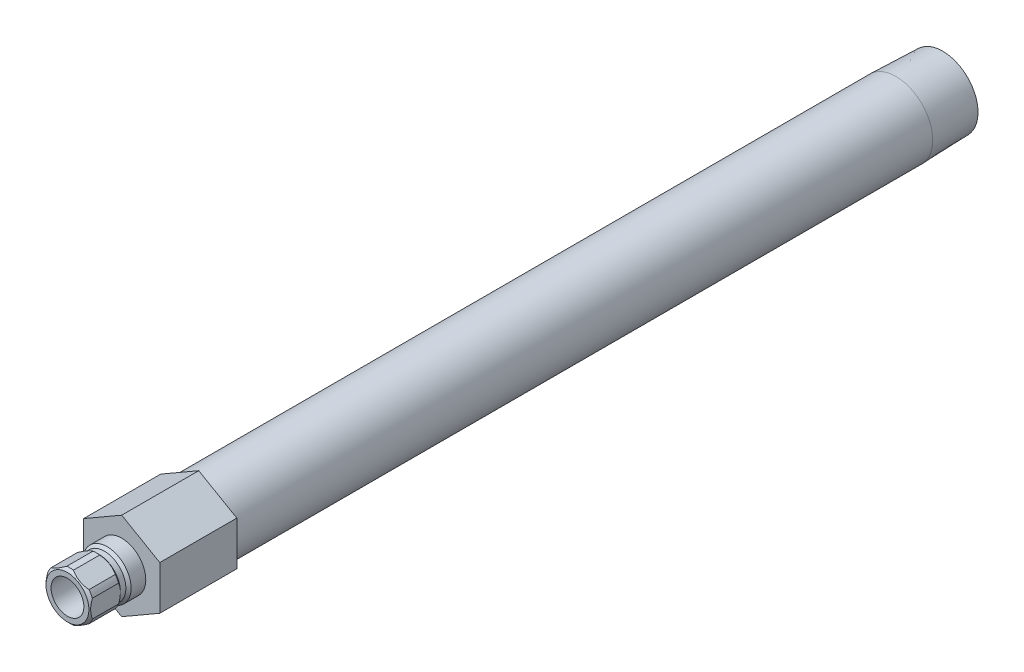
ISO-10303-21;
HEADER;
FILE_DESCRIPTION(('STEP AP214'),'2;1');
FILE_NAME('part.step','',(''),(''),'','','');
FILE_SCHEMA(('AUTOMOTIVE_DESIGN { 1 0 10303 214 1 1 1 1 }'));
ENDSEC;
DATA;
#1=APPLICATION_CONTEXT('core data for automotive mechanical design processes');
#2=APPLICATION_PROTOCOL_DEFINITION('international standard','automotive_design',2000,#1);
#3=PRODUCT_CONTEXT('',#1,'mechanical');
#4=PRODUCT('Part','Part','',(#3));
#5=PRODUCT_RELATED_PRODUCT_CATEGORY('part','',(#4));
#6=PRODUCT_DEFINITION_FORMATION('','',#4);
#7=PRODUCT_DEFINITION_CONTEXT('part definition',#1,'design');
#8=PRODUCT_DEFINITION('design','',#6,#7);
#9=PRODUCT_DEFINITION_SHAPE('','',#8);
#10=(LENGTH_UNIT() NAMED_UNIT(*) SI_UNIT(.MILLI.,.METRE.));
#11=(NAMED_UNIT(*) PLANE_ANGLE_UNIT() SI_UNIT($,.RADIAN.));
#12=(NAMED_UNIT(*) SI_UNIT($,.STERADIAN.) SOLID_ANGLE_UNIT());
#13=UNCERTAINTY_MEASURE_WITH_UNIT(LENGTH_MEASURE(1.E-05),#10,'distance_accuracy_value','');
#14=(GEOMETRIC_REPRESENTATION_CONTEXT(3) GLOBAL_UNCERTAINTY_ASSIGNED_CONTEXT((#13)) GLOBAL_UNIT_ASSIGNED_CONTEXT((#10,
#11,#12)) REPRESENTATION_CONTEXT('',''));
#15=CARTESIAN_POINT('',(0.,0.,0.));
#16=DIRECTION('',(0.,0.,1.));
#17=DIRECTION('',(1.,0.,0.));
#18=AXIS2_PLACEMENT_3D('',#15,#16,#17);
#19=CARTESIAN_POINT('',(0.,0.,13.1223734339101));
#20=DIRECTION('',(0.,0.,-1.));
#21=DIRECTION('',(0.,1.,0.));
#22=AXIS2_PLACEMENT_3D('',#19,#20,#21);
#23=CYLINDRICAL_SURFACE('',#22,6.985);
#24=DIRECTION('',(0.,0.,-1.));
#25=VECTOR('',#24,1.);
#26=CARTESIAN_POINT('',(5.50323442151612,-4.30170151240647,13.1223734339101));
#27=LINE('',#26,#25);
#28=CARTESIAN_POINT('',(5.50323442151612,-4.30170151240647,7.366));
#29=VERTEX_POINT('',#28);
#30=CARTESIAN_POINT('',(5.50323442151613,-4.30170151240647,14.986));
#31=VERTEX_POINT('',#30);
#32=EDGE_CURVE('E406',#29,#31,#27,.F.);
#33=ORIENTED_EDGE('',*,*,#32,.F.);
#34=CARTESIAN_POINT('',(0.,0.,7.366));
#35=DIRECTION('',(0.,0.,-1.));
#36=DIRECTION('',(0.,1.,0.));
#37=AXIS2_PLACEMENT_3D('',#34,#35,#36);
#38=CIRCLE('',#37,6.985);
#39=CARTESIAN_POINT('',(6.477,-2.61509005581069,7.366));
#40=VERTEX_POINT('',#39);
#41=EDGE_CURVE('E383',#40,#29,#38,.T.);
#42=ORIENTED_EDGE('',*,*,#41,.F.);
#43=DIRECTION('',(0.,0.,-1.));
#44=VECTOR('',#43,1.);
#45=CARTESIAN_POINT('',(6.477,-2.61509005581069,13.1223734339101));
#46=LINE('',#45,#44);
#47=CARTESIAN_POINT('',(6.477,-2.6150900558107,14.986));
#48=VERTEX_POINT('',#47);
#49=EDGE_CURVE('E397',#48,#40,#46,.T.);
#50=ORIENTED_EDGE('',*,*,#49,.F.);
#51=CARTESIAN_POINT('',(0.,0.,14.986));
#52=DIRECTION('',(0.,0.,-1.));
#53=DIRECTION('',(0.,1.,0.));
#54=AXIS2_PLACEMENT_3D('',#51,#52,#53);
#55=CIRCLE('',#54,6.985);
#56=EDGE_CURVE('E191',#48,#31,#55,.T.);
#57=ORIENTED_EDGE('',*,*,#56,.T.);
#58=EDGE_LOOP('',(#33,#42,#50,#57));
#59=FACE_BOUND('',#58,.T.);
#60=ADVANCED_FACE('F34',(#59),#23,.T.);
#61=DIRECTION('',(0.,0.,-1.));
#62=VECTOR('',#61,1.);
#63=CARTESIAN_POINT('',(6.477,2.6150900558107,13.1223734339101));
#64=LINE('',#63,#62);
#65=CARTESIAN_POINT('',(6.477,2.6150900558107,7.366));
#66=VERTEX_POINT('',#65);
#67=CARTESIAN_POINT('',(6.477,2.6150900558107,14.986));
#68=VERTEX_POINT('',#67);
#69=EDGE_CURVE('E309',#66,#68,#64,.F.);
#70=ORIENTED_EDGE('',*,*,#69,.F.);
#71=CARTESIAN_POINT('',(5.50323442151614,4.30170151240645,7.366));
#72=VERTEX_POINT('',#71);
#73=EDGE_CURVE('E204',#72,#66,#38,.T.);
#74=ORIENTED_EDGE('',*,*,#73,.F.);
#75=DIRECTION('',(0.,0.,-1.));
#76=VECTOR('',#75,1.);
#77=CARTESIAN_POINT('',(5.50323442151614,4.30170151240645,13.1223734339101));
#78=LINE('',#77,#76);
#79=CARTESIAN_POINT('',(5.50323442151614,4.30170151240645,14.986));
#80=VERTEX_POINT('',#79);
#81=EDGE_CURVE('E394',#80,#72,#78,.T.);
#82=ORIENTED_EDGE('',*,*,#81,.F.);
#83=EDGE_CURVE('E198',#80,#68,#55,.T.);
#84=ORIENTED_EDGE('',*,*,#83,.T.);
#85=EDGE_LOOP('',(#70,#74,#82,#84));
#86=FACE_BOUND('',#85,.T.);
#87=ADVANCED_FACE('F343',(#86),#23,.T.);
#88=DIRECTION('',(0.,0.,-1.));
#89=VECTOR('',#88,1.);
#90=CARTESIAN_POINT('',(0.973765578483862,6.91679156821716,13.1223734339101));
#91=LINE('',#90,#89);
#92=CARTESIAN_POINT('',(0.973765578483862,6.91679156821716,7.366));
#93=VERTEX_POINT('',#92);
#94=CARTESIAN_POINT('',(0.973765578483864,6.91679156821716,14.986));
#95=VERTEX_POINT('',#94);
#96=EDGE_CURVE('E399',#93,#95,#91,.F.);
#97=ORIENTED_EDGE('',*,*,#96,.F.);
#98=CARTESIAN_POINT('',(-0.973765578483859,6.91679156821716,7.366));
#99=VERTEX_POINT('',#98);
#100=EDGE_CURVE('E200',#99,#93,#38,.T.);
#101=ORIENTED_EDGE('',*,*,#100,.F.);
#102=DIRECTION('',(0.,0.,-1.));
#103=VECTOR('',#102,1.);
#104=CARTESIAN_POINT('',(-0.973765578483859,6.91679156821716,13.1223734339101));
#105=LINE('',#104,#103);
#106=CARTESIAN_POINT('',(-0.973765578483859,6.91679156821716,14.986));
#107=VERTEX_POINT('',#106);
#108=EDGE_CURVE('E375',#107,#99,#105,.T.);
#109=ORIENTED_EDGE('',*,*,#108,.F.);
#110=EDGE_CURVE('E193',#107,#95,#55,.T.);
#111=ORIENTED_EDGE('',*,*,#110,.T.);
#112=EDGE_LOOP('',(#97,#101,#109,#111));
#113=FACE_BOUND('',#112,.T.);
#114=ADVANCED_FACE('F348',(#113),#23,.T.);
#115=DIRECTION('',(0.,0.,-1.));
#116=VECTOR('',#115,1.);
#117=CARTESIAN_POINT('',(-5.50323442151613,4.30170151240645,13.1223734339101));
#118=LINE('',#117,#116);
#119=CARTESIAN_POINT('',(-5.50323442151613,4.30170151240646,7.366));
#120=VERTEX_POINT('',#119);
#121=CARTESIAN_POINT('',(-5.50323442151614,4.30170151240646,14.986));
#122=VERTEX_POINT('',#121);
#123=EDGE_CURVE('E54',#120,#122,#118,.F.);
#124=ORIENTED_EDGE('',*,*,#123,.F.);
#125=CARTESIAN_POINT('',(-6.477,2.6150900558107,7.366));
#126=VERTEX_POINT('',#125);
#127=EDGE_CURVE('E203',#126,#120,#38,.T.);
#128=ORIENTED_EDGE('',*,*,#127,.F.);
#129=DIRECTION('',(0.,0.,-1.));
#130=VECTOR('',#129,1.);
#131=CARTESIAN_POINT('',(-6.477,2.6150900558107,13.1223734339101));
#132=LINE('',#131,#130);
#133=CARTESIAN_POINT('',(-6.477,2.61509005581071,14.986));
#134=VERTEX_POINT('',#133);
#135=EDGE_CURVE('E263',#134,#126,#132,.T.);
#136=ORIENTED_EDGE('',*,*,#135,.F.);
#137=EDGE_CURVE('E189',#134,#122,#55,.T.);
#138=ORIENTED_EDGE('',*,*,#137,.T.);
#139=EDGE_LOOP('',(#124,#128,#136,#138));
#140=FACE_BOUND('',#139,.T.);
#141=ADVANCED_FACE('F360',(#140),#23,.T.);
#142=DIRECTION('',(0.,0.,-1.));
#143=VECTOR('',#142,1.);
#144=CARTESIAN_POINT('',(-6.477,-2.6150900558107,13.1223734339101));
#145=LINE('',#144,#143);
#146=CARTESIAN_POINT('',(-6.477,-2.61509005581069,7.366));
#147=VERTEX_POINT('',#146);
#148=CARTESIAN_POINT('',(-6.477,-2.6150900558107,14.986));
#149=VERTEX_POINT('',#148);
#150=EDGE_CURVE('E62',#147,#149,#145,.F.);
#151=ORIENTED_EDGE('',*,*,#150,.F.);
#152=CARTESIAN_POINT('',(-5.50323442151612,-4.30170151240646,7.366));
#153=VERTEX_POINT('',#152);
#154=EDGE_CURVE('E182',#153,#147,#38,.T.);
#155=ORIENTED_EDGE('',*,*,#154,.F.);
#156=DIRECTION('',(0.,0.,-1.));
#157=VECTOR('',#156,1.);
#158=CARTESIAN_POINT('',(-5.50323442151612,-4.30170151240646,13.1223734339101));
#159=LINE('',#158,#157);
#160=CARTESIAN_POINT('',(-5.50323442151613,-4.30170151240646,14.986));
#161=VERTEX_POINT('',#160);
#162=EDGE_CURVE('E165',#161,#153,#159,.T.);
#163=ORIENTED_EDGE('',*,*,#162,.F.);
#164=EDGE_CURVE('E180',#161,#149,#55,.T.);
#165=ORIENTED_EDGE('',*,*,#164,.T.);
#166=EDGE_LOOP('',(#151,#155,#163,#165));
#167=FACE_BOUND('',#166,.T.);
#168=ADVANCED_FACE('F179',(#167),#23,.T.);
#169=CARTESIAN_POINT('',(0.,0.,13.1223734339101));
#170=DIRECTION('',(0.,0.,-1.));
#171=DIRECTION('',(0.,1.,0.));
#172=AXIS2_PLACEMENT_3D('',#169,#170,#171);
#173=CYLINDRICAL_SURFACE('',#172,10.6679999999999);
#174=CARTESIAN_POINT('',(0.,1.09761599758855E-13,-224.6884));
#175=DIRECTION('',(0.,0.,-1.));
#176=DIRECTION('',(0.,1.,0.));
#177=AXIS2_PLACEMENT_3D('',#174,#175,#176);
#178=CIRCLE('',#177,10.6679999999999);
#179=CARTESIAN_POINT('',(0.,10.668,-224.6884));
#180=VERTEX_POINT('',#179);
#181=EDGE_CURVE('E217',#180,#180,#178,.T.);
#182=ORIENTED_EDGE('',*,*,#181,.F.);
#183=EDGE_LOOP('',(#182));
#184=FACE_BOUND('',#183,.T.);
#185=CARTESIAN_POINT('',(0.,0.,-22.352));
#186=DIRECTION('',(0.,0.,1.));
#187=DIRECTION('',(1.,0.,0.));
#188=AXIS2_PLACEMENT_3D('',#185,#186,#187);
#189=CIRCLE('',#188,10.6679999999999);
#190=CARTESIAN_POINT('',(10.6679999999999,0.,-22.352));
#191=VERTEX_POINT('',#190);
#192=EDGE_CURVE('E231',#191,#191,#189,.F.);
#193=ORIENTED_EDGE('',*,*,#192,.T.);
#194=EDGE_LOOP('',(#193));
#195=FACE_BOUND('',#194,.T.);
#196=ADVANCED_FACE('F359',(#184,#195),#173,.T.);
#197=CARTESIAN_POINT('',(0.,0.,13.1223734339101));
#198=DIRECTION('',(0.,0.,-1.));
#199=DIRECTION('',(0.,1.,0.));
#200=AXIS2_PLACEMENT_3D('',#197,#198,#199);
#201=CYLINDRICAL_SURFACE('',#200,4.76249999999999);
#202=CARTESIAN_POINT('',(0.,0.,15.748));
#203=DIRECTION('',(0.,0.,-1.));
#204=DIRECTION('',(0.,1.,0.));
#205=AXIS2_PLACEMENT_3D('',#202,#203,#204);
#206=CIRCLE('',#205,4.7625);
#207=CARTESIAN_POINT('',(0.,4.7625,15.748));
#208=VERTEX_POINT('',#207);
#209=EDGE_CURVE('E233',#208,#208,#206,.T.);
#210=ORIENTED_EDGE('',*,*,#209,.F.);
#211=EDGE_LOOP('',(#210));
#212=FACE_BOUND('',#211,.T.);
#213=CARTESIAN_POINT('',(0.,0.,-22.352));
#214=DIRECTION('',(0.,0.,-1.));
#215=DIRECTION('',(0.,1.,0.));
#216=AXIS2_PLACEMENT_3D('',#213,#214,#215);
#217=CIRCLE('',#216,4.76249999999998);
#218=CARTESIAN_POINT('',(0.,4.7625,-22.352));
#219=VERTEX_POINT('',#218);
#220=EDGE_CURVE('E174',#219,#219,#217,.T.);
#221=ORIENTED_EDGE('',*,*,#220,.T.);
#222=EDGE_LOOP('',(#221));
#223=FACE_BOUND('',#222,.T.);
#224=ADVANCED_FACE('F36',(#212,#223),#201,.F.);
#225=CARTESIAN_POINT('',(0.,4.7625,-22.352));
#226=DIRECTION('',(0.,0.,-1.));
#227=DIRECTION('',(0.,1.,0.));
#228=AXIS2_PLACEMENT_3D('',#225,#226,#227);
#229=PLANE('',#228);
#230=CARTESIAN_POINT('',(0.,0.,-22.352));
#231=DIRECTION('',(0.,0.,-1.));
#232=DIRECTION('',(0.,1.,0.));
#233=AXIS2_PLACEMENT_3D('',#230,#231,#232);
#234=CIRCLE('',#233,7.89939999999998);
#235=CARTESIAN_POINT('',(0.,7.8994,-22.352));
#236=VERTEX_POINT('',#235);
#237=EDGE_CURVE('E226',#236,#236,#234,.T.);
#238=ORIENTED_EDGE('',*,*,#237,.T.);
#239=EDGE_LOOP('',(#238));
#240=FACE_BOUND('',#239,.T.);
#241=ORIENTED_EDGE('',*,*,#220,.F.);
#242=EDGE_LOOP('',(#241));
#243=FACE_BOUND('',#242,.T.);
#244=ADVANCED_FACE('F533',(#240,#243),#229,.T.);
#245=CARTESIAN_POINT('',(0.,0.,13.1223734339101));
#246=DIRECTION('',(0.,0.,-1.));
#247=DIRECTION('',(0.,1.,0.));
#248=AXIS2_PLACEMENT_3D('',#245,#246,#247);
#249=CYLINDRICAL_SURFACE('',#248,7.89939999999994);
#250=CARTESIAN_POINT('',(0.,1.15921110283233E-13,-238.252));
#251=DIRECTION('',(0.,0.,-1.));
#252=DIRECTION('',(0.,1.,0.));
#253=AXIS2_PLACEMENT_3D('',#250,#251,#252);
#254=CIRCLE('',#253,7.89939999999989);
#255=CARTESIAN_POINT('',(0.,7.8994,-238.252));
#256=VERTEX_POINT('',#255);
#257=EDGE_CURVE('E223',#256,#256,#254,.T.);
#258=ORIENTED_EDGE('',*,*,#257,.T.);
#259=EDGE_LOOP('',(#258));
#260=FACE_BOUND('',#259,.T.);
#261=ORIENTED_EDGE('',*,*,#237,.F.);
#262=EDGE_LOOP('',(#261));
#263=FACE_BOUND('',#262,.T.);
#264=ADVANCED_FACE('F530',(#260,#263),#249,.F.);
#265=CARTESIAN_POINT('',(0.,10.244140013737,-238.252));
#266=DIRECTION('',(0.,0.,-1.));
#267=DIRECTION('',(0.,1.,0.));
#268=AXIS2_PLACEMENT_3D('',#265,#266,#267);
#269=PLANE('',#268);
#270=CARTESIAN_POINT('',(0.,1.15921110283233E-13,-238.252));
#271=DIRECTION('',(0.,0.,-1.));
#272=DIRECTION('',(0.,1.,0.));
#273=AXIS2_PLACEMENT_3D('',#270,#271,#272);
#274=CIRCLE('',#273,10.2441400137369);
#275=CARTESIAN_POINT('',(0.,10.244140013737,-238.252));
#276=VERTEX_POINT('',#275);
#277=EDGE_CURVE('E220',#276,#276,#274,.T.);
#278=ORIENTED_EDGE('',*,*,#277,.T.);
#279=EDGE_LOOP('',(#278));
#280=FACE_BOUND('',#279,.T.);
#281=ORIENTED_EDGE('',*,*,#257,.F.);
#282=EDGE_LOOP('',(#281));
#283=FACE_BOUND('',#282,.T.);
#284=ADVANCED_FACE('F524',(#280,#283),#269,.T.);
#285=CARTESIAN_POINT('',(0.,1.15921110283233E-13,-238.252));
#286=DIRECTION('',(0.,0.,1.));
#287=DIRECTION('',(0.,-1.,0.));
#288=AXIS2_PLACEMENT_3D('',#285,#286,#287);
#289=CONICAL_SURFACE('',#288,10.2441400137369,0.0312396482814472);
#290=ORIENTED_EDGE('',*,*,#181,.T.);
#291=EDGE_LOOP('',(#290));
#292=FACE_BOUND('',#291,.T.);
#293=ORIENTED_EDGE('',*,*,#277,.F.);
#294=EDGE_LOOP('',(#293));
#295=FACE_BOUND('',#294,.T.);
#296=ADVANCED_FACE('F514',(#292,#295),#289,.T.);
#297=CARTESIAN_POINT('',(0.,6.985,0.));
#298=DIRECTION('',(0.,0.,1.));
#299=DIRECTION('',(0.,-1.,0.));
#300=AXIS2_PLACEMENT_3D('',#297,#298,#299);
#301=PLANE('',#300);
#302=CARTESIAN_POINT('',(0.,0.,0.));
#303=DIRECTION('',(0.,0.,-1.));
#304=DIRECTION('',(0.,1.,0.));
#305=AXIS2_PLACEMENT_3D('',#302,#303,#304);
#306=CIRCLE('',#305,6.98499999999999);
#307=CARTESIAN_POINT('',(0.,6.985,0.));
#308=VERTEX_POINT('',#307);
#309=EDGE_CURVE('E214',#308,#308,#306,.T.);
#310=ORIENTED_EDGE('',*,*,#309,.T.);
#311=EDGE_LOOP('',(#310));
#312=FACE_BOUND('',#311,.T.);
#313=DIRECTION('',(-0.866025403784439,-0.5,0.));
#314=VECTOR('',#313,1.);
#315=CARTESIAN_POINT('',(0.,12.7582862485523,0.));
#316=LINE('',#315,#314);
#317=CARTESIAN_POINT('',(0.,12.7582862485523,0.));
#318=VERTEX_POINT('',#317);
#319=CARTESIAN_POINT('',(-11.049,6.37914312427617,0.));
#320=VERTEX_POINT('',#319);
#321=EDGE_CURVE('E409',#318,#320,#316,.T.);
#322=ORIENTED_EDGE('',*,*,#321,.T.);
#323=DIRECTION('',(0.,-1.,0.));
#324=VECTOR('',#323,1.);
#325=CARTESIAN_POINT('',(-11.049,6.37914312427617,0.));
#326=LINE('',#325,#324);
#327=CARTESIAN_POINT('',(-11.049,-6.37914312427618,0.));
#328=VERTEX_POINT('',#327);
#329=EDGE_CURVE('E436',#320,#328,#326,.T.);
#330=ORIENTED_EDGE('',*,*,#329,.T.);
#331=DIRECTION('',(0.866025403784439,-0.5,0.));
#332=VECTOR('',#331,1.);
#333=CARTESIAN_POINT('',(-11.049,-6.37914312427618,0.));
#334=LINE('',#333,#332);
#335=CARTESIAN_POINT('',(0.,-12.7582862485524,0.));
#336=VERTEX_POINT('',#335);
#337=EDGE_CURVE('E439',#328,#336,#334,.T.);
#338=ORIENTED_EDGE('',*,*,#337,.T.);
#339=DIRECTION('',(0.866025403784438,0.5,0.));
#340=VECTOR('',#339,1.);
#341=CARTESIAN_POINT('',(0.,-12.7582862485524,0.));
#342=LINE('',#341,#340);
#343=CARTESIAN_POINT('',(11.049,-6.37914312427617,0.));
#344=VERTEX_POINT('',#343);
#345=EDGE_CURVE('E442',#336,#344,#342,.T.);
#346=ORIENTED_EDGE('',*,*,#345,.T.);
#347=DIRECTION('',(0.,1.,0.));
#348=VECTOR('',#347,1.);
#349=CARTESIAN_POINT('',(11.049,-6.37914312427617,0.));
#350=LINE('',#349,#348);
#351=CARTESIAN_POINT('',(11.049,6.37914312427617,0.));
#352=VERTEX_POINT('',#351);
#353=EDGE_CURVE('E445',#344,#352,#350,.T.);
#354=ORIENTED_EDGE('',*,*,#353,.T.);
#355=DIRECTION('',(-0.866025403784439,0.5,0.));
#356=VECTOR('',#355,1.);
#357=CARTESIAN_POINT('',(11.049,6.37914312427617,0.));
#358=LINE('',#357,#356);
#359=EDGE_CURVE('E418',#352,#318,#358,.T.);
#360=ORIENTED_EDGE('',*,*,#359,.T.);
#361=EDGE_LOOP('',(#322,#330,#338,#346,#354,#360));
#362=FACE_BOUND('',#361,.T.);
#363=ADVANCED_FACE('F511',(#312,#362),#301,.T.);
#364=CARTESIAN_POINT('',(0.,0.,13.1223734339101));
#365=DIRECTION('',(0.,0.,-1.));
#366=DIRECTION('',(0.,1.,0.));
#367=AXIS2_PLACEMENT_3D('',#364,#365,#366);
#368=CYLINDRICAL_SURFACE('',#367,6.98499999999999);
#369=CARTESIAN_POINT('',(0.,0.,4.25449999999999));
#370=DIRECTION('',(0.,0.,-1.));
#371=DIRECTION('',(0.,1.,0.));
#372=AXIS2_PLACEMENT_3D('',#369,#370,#371);
#373=CIRCLE('',#372,6.98499999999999);
#374=CARTESIAN_POINT('',(0.,6.985,4.2545));
#375=VERTEX_POINT('',#374);
#376=EDGE_CURVE('E211',#375,#375,#373,.T.);
#377=ORIENTED_EDGE('',*,*,#376,.T.);
#378=EDGE_LOOP('',(#377));
#379=FACE_BOUND('',#378,.T.);
#380=ORIENTED_EDGE('',*,*,#309,.F.);
#381=EDGE_LOOP('',(#380));
#382=FACE_BOUND('',#381,.T.);
#383=ADVANCED_FACE('F513',(#379,#382),#368,.T.);
#384=CARTESIAN_POINT('',(0.,0.,4.25449999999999));
#385=DIRECTION('',(0.,0.,-1.));
#386=DIRECTION('',(0.,1.,0.));
#387=AXIS2_PLACEMENT_3D('',#384,#385,#386);
#388=CONICAL_SURFACE('',#387,6.98499999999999,0.785398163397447);
#389=CARTESIAN_POINT('',(0.,0.,5.0165));
#390=DIRECTION('',(0.,0.,-1.));
#391=DIRECTION('',(0.,1.,0.));
#392=AXIS2_PLACEMENT_3D('',#389,#390,#391);
#393=CIRCLE('',#392,6.223);
#394=CARTESIAN_POINT('',(0.,6.223,5.0165));
#395=VERTEX_POINT('',#394);
#396=EDGE_CURVE('E208',#395,#395,#393,.T.);
#397=ORIENTED_EDGE('',*,*,#396,.T.);
#398=EDGE_LOOP('',(#397));
#399=FACE_BOUND('',#398,.T.);
#400=ORIENTED_EDGE('',*,*,#376,.F.);
#401=EDGE_LOOP('',(#400));
#402=FACE_BOUND('',#401,.T.);
#403=ADVANCED_FACE('F521',(#399,#402),#388,.T.);
#404=CARTESIAN_POINT('',(0.,0.,13.1223734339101));
#405=DIRECTION('',(0.,0.,-1.));
#406=DIRECTION('',(0.,1.,0.));
#407=AXIS2_PLACEMENT_3D('',#404,#405,#406);
#408=CYLINDRICAL_SURFACE('',#407,6.223);
#409=CARTESIAN_POINT('',(0.,0.,6.604));
#410=DIRECTION('',(0.,0.,-1.));
#411=DIRECTION('',(0.,1.,0.));
#412=AXIS2_PLACEMENT_3D('',#409,#410,#411);
#413=CIRCLE('',#412,6.223);
#414=CARTESIAN_POINT('',(0.,6.223,6.604));
#415=VERTEX_POINT('',#414);
#416=EDGE_CURVE('E205',#415,#415,#413,.T.);
#417=ORIENTED_EDGE('',*,*,#416,.T.);
#418=EDGE_LOOP('',(#417));
#419=FACE_BOUND('',#418,.T.);
#420=ORIENTED_EDGE('',*,*,#396,.F.);
#421=EDGE_LOOP('',(#420));
#422=FACE_BOUND('',#421,.T.);
#423=ADVANCED_FACE('F270',(#419,#422),#408,.T.);
#424=CARTESIAN_POINT('',(0.,0.,6.604));
#425=DIRECTION('',(0.,0.,1.));
#426=DIRECTION('',(0.,-1.,0.));
#427=AXIS2_PLACEMENT_3D('',#424,#425,#426);
#428=CONICAL_SURFACE('',#427,6.223,0.785398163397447);
#429=CARTESIAN_POINT('',(0.97330298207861,-6.91705864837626,7.3662));
#430=CARTESIAN_POINT('',(1.15430521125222,-6.81255696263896,7.28788330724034));
#431=CARTESIAN_POINT('',(1.33782092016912,-6.70660411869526,7.21664558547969));
#432=CARTESIAN_POINT('',(1.70963160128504,-6.49193912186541,7.09114753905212));
#433=CARTESIAN_POINT('',(1.89793754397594,-6.38322063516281,7.03693086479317));
#434=CARTESIAN_POINT('',(2.27146153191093,-6.16756646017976,6.95027563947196));
#435=CARTESIAN_POINT('',(2.45655498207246,-6.06070270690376,6.91713772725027));
#436=CARTESIAN_POINT('',(2.82844640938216,-5.8459910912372,6.87178043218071));
#437=CARTESIAN_POINT('',(3.01524193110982,-5.73814464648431,6.85953461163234));
#438=CARTESIAN_POINT('',(3.39480578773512,-5.51900335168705,6.85669437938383));
#439=CARTESIAN_POINT('',(3.58757842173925,-5.40770601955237,6.86678827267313));
#440=CARTESIAN_POINT('',(3.97148128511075,-5.18605959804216,6.9093291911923));
#441=CARTESIAN_POINT('',(4.16260891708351,-5.07571200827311,6.9418066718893));
#442=CARTESIAN_POINT('',(4.54854122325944,-4.85289388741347,7.02857263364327));
#443=CARTESIAN_POINT('',(4.74321398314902,-4.74049951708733,7.08363522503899));
#444=CARTESIAN_POINT('',(5.03141021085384,-4.57410934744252,7.17999209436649));
#445=CARTESIAN_POINT('',(5.12673323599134,-4.51907457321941,7.21435772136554));
#446=CARTESIAN_POINT('',(5.31613879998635,-4.40972121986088,7.28725547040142));
#447=CARTESIAN_POINT('',(5.41022179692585,-4.3554023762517,7.32578600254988));
#448=CARTESIAN_POINT('',(5.50369701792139,-4.30143443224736,7.3662));
#449=B_SPLINE_CURVE_WITH_KNOTS('',3,(#429,#430,#431,#432,#433,#434,#435,#436,#437,#438,#439,
#440,#441,#442,#443,#444,#445,#446,#447,#448),.UNSPECIFIED.,.F.,.F.,(4,2,2,2,2,2,2,2,2,4),(0.,
0.669810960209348,1.34132587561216,1.9892054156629,2.63626449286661,3.30353665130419,
3.97171850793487,4.66502165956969,5.01088265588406,5.35661208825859),.UNSPECIFIED.);
#450=CARTESIAN_POINT('',(0.973765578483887,-6.91679156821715,7.366));
#451=VERTEX_POINT('',#450);
#452=EDGE_CURVE('E408',#451,#29,#449,.T.);
#453=ORIENTED_EDGE('',*,*,#452,.F.);
#454=CARTESIAN_POINT('',(-0.97376557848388,-6.91679156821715,7.366));
#455=VERTEX_POINT('',#454);
#456=EDGE_CURVE('E381',#451,#455,#38,.T.);
#457=ORIENTED_EDGE('',*,*,#456,.T.);
#458=CARTESIAN_POINT('',(-5.50369701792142,-4.30143443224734,7.36620000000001));
#459=CARTESIAN_POINT('',(-5.32269478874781,-4.40593611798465,7.28788330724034));
#460=CARTESIAN_POINT('',(-5.13917907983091,-4.51188896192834,7.2166455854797));
#461=CARTESIAN_POINT('',(-4.76736839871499,-4.7265539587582,7.09114753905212));
#462=CARTESIAN_POINT('',(-4.57906245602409,-4.83527244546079,7.03693086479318));
#463=CARTESIAN_POINT('',(-4.20553846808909,-5.05092662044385,6.95027563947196));
#464=CARTESIAN_POINT('',(-4.02044501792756,-5.15779037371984,6.91713772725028));
#465=CARTESIAN_POINT('',(-3.64855359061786,-5.37250198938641,6.87178043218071));
#466=CARTESIAN_POINT('',(-3.4617580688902,-5.48034843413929,6.85953461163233));
#467=CARTESIAN_POINT('',(-3.0821942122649,-5.69948972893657,6.85669437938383));
#468=CARTESIAN_POINT('',(-2.88942157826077,-5.81078706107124,6.86678827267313));
#469=CARTESIAN_POINT('',(-2.50551871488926,-6.03243348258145,6.90932919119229));
#470=CARTESIAN_POINT('',(-2.3143910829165,-6.1427810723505,6.9418066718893));
#471=CARTESIAN_POINT('',(-1.92845877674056,-6.36559919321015,7.02857263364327));
#472=CARTESIAN_POINT('',(-1.73378601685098,-6.47799356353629,7.08363522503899));
#473=CARTESIAN_POINT('',(-1.44558978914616,-6.6443837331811,7.17999209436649));
#474=CARTESIAN_POINT('',(-1.35026676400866,-6.69941850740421,7.21435772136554));
#475=CARTESIAN_POINT('',(-1.16086120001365,-6.80877186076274,7.28725547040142));
#476=CARTESIAN_POINT('',(-1.06677820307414,-6.86309070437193,7.32578600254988));
#477=CARTESIAN_POINT('',(-0.973302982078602,-6.91705864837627,7.3662));
#478=B_SPLINE_CURVE_WITH_KNOTS('',3,(#458,#459,#460,#461,#462,#463,#464,#465,#466,#467,#468,
#469,#470,#471,#472,#473,#474,#475,#476,#477),.UNSPECIFIED.,.F.,.F.,(4,2,2,2,2,2,2,2,2,4),(0.,
0.669810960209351,1.34132587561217,1.98920541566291,2.63626449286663,3.30353665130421,
3.97171850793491,4.66502165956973,5.0108826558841,5.35661208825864),.UNSPECIFIED.);
#479=EDGE_CURVE('E256',#153,#455,#478,.T.);
#480=ORIENTED_EDGE('',*,*,#479,.F.);
#481=ORIENTED_EDGE('',*,*,#154,.T.);
#482=CARTESIAN_POINT('',(-6.477,-7.50531717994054,10.2946933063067));
#483=CARTESIAN_POINT('',(-6.477,-7.32278230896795,10.1565337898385));
#484=CARTESIAN_POINT('',(-6.477,-7.13923073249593,10.0196957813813));
#485=CARTESIAN_POINT('',(-6.477,-6.76969107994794,9.74925615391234));
#486=CARTESIAN_POINT('',(-6.477,-6.58370240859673,9.61565534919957));
#487=CARTESIAN_POINT('',(-6.477,-6.20752484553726,9.35133325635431));
#488=CARTESIAN_POINT('',(-6.477,-6.01731457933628,9.22064228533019));
#489=CARTESIAN_POINT('',(-6.477,-5.63367369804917,8.96409124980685));
#490=CARTESIAN_POINT('',(-6.477,-5.44024331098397,8.83823084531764));
#491=CARTESIAN_POINT('',(-6.477,-5.03831720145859,8.58528971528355));
#492=CARTESIAN_POINT('',(-6.477,-4.8295984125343,8.45856164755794));
#493=CARTESIAN_POINT('',(-6.477,-4.4072839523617,8.21337587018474));
#494=CARTESIAN_POINT('',(-6.477,-4.19368750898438,8.09491948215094));
#495=CARTESIAN_POINT('',(-6.477,-3.7616267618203,7.8688284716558));
#496=CARTESIAN_POINT('',(-6.477,-3.54317924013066,7.76116202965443));
#497=CARTESIAN_POINT('',(-6.477,-3.100295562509,7.55906153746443));
#498=CARTESIAN_POINT('',(-6.477,-2.87586219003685,7.46462146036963));
#499=CARTESIAN_POINT('',(-6.477,-2.43955826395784,7.2995033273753));
#500=CARTESIAN_POINT('',(-6.477,-2.22819339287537,7.2275028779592));
#501=CARTESIAN_POINT('',(-6.477,-1.80033354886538,7.10045249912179));
#502=CARTESIAN_POINT('',(-6.477,-1.58383822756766,7.0454037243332));
#503=CARTESIAN_POINT('',(-6.477,-1.15063390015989,6.95606140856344));
#504=CARTESIAN_POINT('',(-6.477,-0.934000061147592,6.92140936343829));
#505=CARTESIAN_POINT('',(-6.477,-0.498364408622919,6.87354056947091));
#506=CARTESIAN_POINT('',(-6.477,-0.279363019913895,6.86032003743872));
#507=CARTESIAN_POINT('',(-6.477,0.150697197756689,6.85631642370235));
#508=CARTESIAN_POINT('',(-6.477,0.361748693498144,6.8647176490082));
#509=CARTESIAN_POINT('',(-6.477,0.782066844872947,6.90168275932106));
#510=CARTESIAN_POINT('',(-6.477,0.991333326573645,6.93024858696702));
#511=CARTESIAN_POINT('',(-6.477,1.41010575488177,7.00646246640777));
#512=CARTESIAN_POINT('',(-6.477,1.61955133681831,7.05443689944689));
#513=CARTESIAN_POINT('',(-6.477,2.03387291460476,7.16689535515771));
#514=CARTESIAN_POINT('',(-6.477,2.23874927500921,7.2313780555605));
#515=CARTESIAN_POINT('',(-6.477,2.66141718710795,7.38044013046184));
#516=CARTESIAN_POINT('',(-6.477,2.87875617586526,7.46628961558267));
#517=CARTESIAN_POINT('',(-6.477,3.30779766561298,7.65118196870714));
#518=CARTESIAN_POINT('',(-6.477,3.51949749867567,7.75023095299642));
#519=CARTESIAN_POINT('',(-6.477,3.93828980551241,7.95916705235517));
#520=CARTESIAN_POINT('',(-6.477,4.14536521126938,8.06908810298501));
#521=CARTESIAN_POINT('',(-6.477,4.5547539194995,8.2973403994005));
#522=CARTESIAN_POINT('',(-6.477,4.75706796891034,8.41567031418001));
#523=CARTESIAN_POINT('',(-6.477,5.1476137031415,8.65303908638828));
#524=CARTESIAN_POINT('',(-6.477,5.33604552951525,8.77175038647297));
#525=CARTESIAN_POINT('',(-6.477,5.70967381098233,9.01417488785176));
#526=CARTESIAN_POINT('',(-6.477,5.89487001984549,9.13788846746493));
#527=CARTESIAN_POINT('',(-6.477,6.26095063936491,9.38840412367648));
#528=CARTESIAN_POINT('',(-6.477,6.44185783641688,9.51517302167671));
#529=CARTESIAN_POINT('',(-6.477,6.80119835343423,9.77207065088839));
#530=CARTESIAN_POINT('',(-6.477,6.97963234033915,9.90219844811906));
#531=CARTESIAN_POINT('',(-6.477,7.1570303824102,10.0336997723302));
#532=B_SPLINE_CURVE_WITH_KNOTS('',3,(#482,#483,#484,#485,#486,#487,#488,#489,#490,#491,#492,
#493,#494,#495,#496,#497,#498,#499,#500,#501,#502,#503,#504,#505,#506,#507,#508,#509,#510,#511,
#512,#513,#514,#515,#516,#517,#518,#519,#520,#521,#522,#523,#524,#525,#526,#527,#528,#529,#530,
#531),.UNSPECIFIED.,.F.,.F.,(4,2,2,2,2,2,2,2,2,2,2,2,2,2,2,2,2,2,2,2,2,2,2,2,4),(0.,
0.686790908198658,1.37375281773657,2.06603541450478,2.75826919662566,3.49065471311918,
4.22315698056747,4.95343127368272,5.68337170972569,6.35265989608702,7.02199365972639,
7.67918147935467,8.33625327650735,8.96890298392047,9.60161364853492,10.2454384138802,
10.8892116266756,11.5897073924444,12.2905288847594,12.9936114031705,13.6965828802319,
14.3646145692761,15.0326968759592,15.6953618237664,16.3578444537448),.UNSPECIFIED.);
#533=EDGE_CURVE('E279',#126,#147,#532,.F.);
#534=ORIENTED_EDGE('',*,*,#533,.F.);
#535=ORIENTED_EDGE('',*,*,#127,.T.);
#536=CARTESIAN_POINT('',(-0.97330298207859,6.91705864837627,7.3662));
#537=CARTESIAN_POINT('',(-1.1543052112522,6.81255696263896,7.28788330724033));
#538=CARTESIAN_POINT('',(-1.3378209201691,6.70660411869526,7.21664558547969));
#539=CARTESIAN_POINT('',(-1.70963160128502,6.49193912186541,7.09114753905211));
#540=CARTESIAN_POINT('',(-1.89793754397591,6.38322063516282,7.03693086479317));
#541=CARTESIAN_POINT('',(-2.27146153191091,6.16756646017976,6.95027563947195));
#542=CARTESIAN_POINT('',(-2.45655498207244,6.06070270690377,6.91713772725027));
#543=CARTESIAN_POINT('',(-2.82844640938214,5.8459910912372,6.87178043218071));
#544=CARTESIAN_POINT('',(-3.0152419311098,5.73814464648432,6.85953461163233));
#545=CARTESIAN_POINT('',(-3.3948057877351,5.51900335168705,6.85669437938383));
#546=CARTESIAN_POINT('',(-3.58757842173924,5.40770601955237,6.86678827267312));
#547=CARTESIAN_POINT('',(-3.97148128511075,5.18605959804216,6.90932919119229));
#548=CARTESIAN_POINT('',(-4.16260891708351,5.07571200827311,6.94180667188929));
#549=CARTESIAN_POINT('',(-4.54854122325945,4.85289388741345,7.02857263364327));
#550=CARTESIAN_POINT('',(-4.74321398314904,4.74049951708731,7.08363522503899));
#551=CARTESIAN_POINT('',(-5.03141021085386,4.5741093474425,7.17999209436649));
#552=CARTESIAN_POINT('',(-5.12673323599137,4.51907457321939,7.21435772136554));
#553=CARTESIAN_POINT('',(-5.31613879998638,4.40972121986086,7.28725547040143));
#554=CARTESIAN_POINT('',(-5.41022179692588,4.35540237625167,7.32578600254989));
#555=CARTESIAN_POINT('',(-5.50369701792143,4.30143443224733,7.36620000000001));
#556=B_SPLINE_CURVE_WITH_KNOTS('',3,(#536,#537,#538,#539,#540,#541,#542,#543,#544,#545,#546,
#547,#548,#549,#550,#551,#552,#553,#554,#555),.UNSPECIFIED.,.F.,.F.,(4,2,2,2,2,2,2,2,2,4),(0.,
0.669810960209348,1.34132587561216,1.9892054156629,2.63626449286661,3.3035366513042,
3.97171850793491,4.66502165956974,5.01088265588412,5.35661208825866),.UNSPECIFIED.);
#557=EDGE_CURVE('E286',#99,#120,#556,.T.);
#558=ORIENTED_EDGE('',*,*,#557,.F.);
#559=ORIENTED_EDGE('',*,*,#100,.T.);
#560=CARTESIAN_POINT('',(5.5036970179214,4.30143443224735,7.3662));
#561=CARTESIAN_POINT('',(5.32269478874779,4.40593611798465,7.28788330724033));
#562=CARTESIAN_POINT('',(5.13917907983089,4.51188896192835,7.21664558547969));
#563=CARTESIAN_POINT('',(4.76736839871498,4.7265539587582,7.09114753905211));
#564=CARTESIAN_POINT('',(4.57906245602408,4.8352724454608,7.03693086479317));
#565=CARTESIAN_POINT('',(4.20553846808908,5.05092662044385,6.95027563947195));
#566=CARTESIAN_POINT('',(4.02044501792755,5.15779037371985,6.91713772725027));
#567=CARTESIAN_POINT('',(3.64855359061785,5.37250198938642,6.87178043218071));
#568=CARTESIAN_POINT('',(3.46175806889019,5.4803484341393,6.85953461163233));
#569=CARTESIAN_POINT('',(3.08219421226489,5.69948972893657,6.85669437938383));
#570=CARTESIAN_POINT('',(2.88942157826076,5.81078706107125,6.86678827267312));
#571=CARTESIAN_POINT('',(2.50551871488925,6.03243348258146,6.90932919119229));
#572=CARTESIAN_POINT('',(2.31439108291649,6.1427810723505,6.94180667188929));
#573=CARTESIAN_POINT('',(1.92845877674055,6.36559919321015,7.02857263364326));
#574=CARTESIAN_POINT('',(1.73378601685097,6.47799356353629,7.08363522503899));
#575=CARTESIAN_POINT('',(1.44558978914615,6.64438373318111,7.17999209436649));
#576=CARTESIAN_POINT('',(1.35026676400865,6.69941850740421,7.21435772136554));
#577=CARTESIAN_POINT('',(1.16086120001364,6.80877186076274,7.28725547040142));
#578=CARTESIAN_POINT('',(1.06677820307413,6.86309070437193,7.32578600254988));
#579=CARTESIAN_POINT('',(0.973302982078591,6.91705864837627,7.3662));
#580=B_SPLINE_CURVE_WITH_KNOTS('',3,(#560,#561,#562,#563,#564,#565,#566,#567,#568,#569,#570,
#571,#572,#573,#574,#575,#576,#577,#578,#579),.UNSPECIFIED.,.F.,.F.,(4,2,2,2,2,2,2,2,2,4),(0.,
0.669810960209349,1.34132587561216,1.9892054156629,2.63626449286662,3.3035366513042,
3.9717185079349,4.66502165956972,5.0108826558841,5.35661208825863),.UNSPECIFIED.);
#581=EDGE_CURVE('E293',#72,#93,#580,.T.);
#582=ORIENTED_EDGE('',*,*,#581,.F.);
#583=ORIENTED_EDGE('',*,*,#73,.T.);
#584=CARTESIAN_POINT('',(6.477,-7.50531717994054,10.2946933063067));
#585=CARTESIAN_POINT('',(6.477,-7.32278230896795,10.1565337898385));
#586=CARTESIAN_POINT('',(6.477,-7.13923073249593,10.0196957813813));
#587=CARTESIAN_POINT('',(6.477,-6.76969107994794,9.74925615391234));
#588=CARTESIAN_POINT('',(6.477,-6.58370240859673,9.61565534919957));
#589=CARTESIAN_POINT('',(6.477,-6.20752484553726,9.35133325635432));
#590=CARTESIAN_POINT('',(6.477,-6.01731457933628,9.22064228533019));
#591=CARTESIAN_POINT('',(6.477,-5.63367369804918,8.96409124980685));
#592=CARTESIAN_POINT('',(6.477,-5.44024331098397,8.83823084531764));
#593=CARTESIAN_POINT('',(6.477,-5.03831720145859,8.58528971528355));
#594=CARTESIAN_POINT('',(6.477,-4.82959841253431,8.45856164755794));
#595=CARTESIAN_POINT('',(6.477,-4.4072839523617,8.21337587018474));
#596=CARTESIAN_POINT('',(6.477,-4.19368750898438,8.09491948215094));
#597=CARTESIAN_POINT('',(6.477,-3.76162676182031,7.8688284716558));
#598=CARTESIAN_POINT('',(6.477,-3.54317924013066,7.76116202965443));
#599=CARTESIAN_POINT('',(6.477,-3.100295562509,7.55906153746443));
#600=CARTESIAN_POINT('',(6.477,-2.87586219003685,7.46462146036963));
#601=CARTESIAN_POINT('',(6.477,-2.43955826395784,7.2995033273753));
#602=CARTESIAN_POINT('',(6.477,-2.22819339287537,7.2275028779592));
#603=CARTESIAN_POINT('',(6.477,-1.80033354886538,7.10045249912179));
#604=CARTESIAN_POINT('',(6.477,-1.58383822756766,7.0454037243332));
#605=CARTESIAN_POINT('',(6.477,-1.15063390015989,6.95606140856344));
#606=CARTESIAN_POINT('',(6.477,-0.934000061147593,6.92140936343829));
#607=CARTESIAN_POINT('',(6.477,-0.498364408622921,6.87354056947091));
#608=CARTESIAN_POINT('',(6.477,-0.279363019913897,6.86032003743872));
#609=CARTESIAN_POINT('',(6.477,0.150697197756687,6.85631642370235));
#610=CARTESIAN_POINT('',(6.477,0.361748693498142,6.8647176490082));
#611=CARTESIAN_POINT('',(6.477,0.782066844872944,6.90168275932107));
#612=CARTESIAN_POINT('',(6.477,0.991333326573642,6.93024858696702));
#613=CARTESIAN_POINT('',(6.477,1.41010575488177,7.00646246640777));
#614=CARTESIAN_POINT('',(6.477,1.6195513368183,7.05443689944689));
#615=CARTESIAN_POINT('',(6.477,2.03387291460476,7.16689535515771));
#616=CARTESIAN_POINT('',(6.477,2.23874927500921,7.2313780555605));
#617=CARTESIAN_POINT('',(6.477,2.66141718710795,7.38044013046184));
#618=CARTESIAN_POINT('',(6.477,2.87875617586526,7.46628961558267));
#619=CARTESIAN_POINT('',(6.477,3.30779766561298,7.65118196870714));
#620=CARTESIAN_POINT('',(6.477,3.51949749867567,7.75023095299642));
#621=CARTESIAN_POINT('',(6.477,3.93828980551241,7.95916705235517));
#622=CARTESIAN_POINT('',(6.477,4.14536521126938,8.06908810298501));
#623=CARTESIAN_POINT('',(6.477,4.5547539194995,8.2973403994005));
#624=CARTESIAN_POINT('',(6.477,4.75706796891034,8.41567031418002));
#625=CARTESIAN_POINT('',(6.477,5.1476137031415,8.65303908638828));
#626=CARTESIAN_POINT('',(6.477,5.33604552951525,8.77175038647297));
#627=CARTESIAN_POINT('',(6.477,5.70967381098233,9.01417488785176));
#628=CARTESIAN_POINT('',(6.477,5.8948700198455,9.13788846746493));
#629=CARTESIAN_POINT('',(6.477,6.26095063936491,9.38840412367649));
#630=CARTESIAN_POINT('',(6.477,6.44185783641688,9.51517302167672));
#631=CARTESIAN_POINT('',(6.477,6.80119835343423,9.77207065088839));
#632=CARTESIAN_POINT('',(6.477,6.97963234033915,9.90219844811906));
#633=CARTESIAN_POINT('',(6.477,7.1570303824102,10.0336997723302));
#634=B_SPLINE_CURVE_WITH_KNOTS('',3,(#584,#585,#586,#587,#588,#589,#590,#591,#592,#593,#594,
#595,#596,#597,#598,#599,#600,#601,#602,#603,#604,#605,#606,#607,#608,#609,#610,#611,#612,#613,
#614,#615,#616,#617,#618,#619,#620,#621,#622,#623,#624,#625,#626,#627,#628,#629,#630,#631,#632,
#633),.UNSPECIFIED.,.F.,.F.,(4,2,2,2,2,2,2,2,2,2,2,2,2,2,2,2,2,2,2,2,2,2,2,2,4),(0.,
0.68679090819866,1.37375281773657,2.06603541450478,2.75826919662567,3.49065471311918,
4.22315698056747,4.95343127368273,5.6833717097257,6.35265989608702,7.02199365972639,
7.67918147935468,8.33625327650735,8.96890298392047,9.60161364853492,10.2454384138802,
10.8892116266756,11.5897073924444,12.2905288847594,12.9936114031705,13.696582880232,
14.3646145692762,15.0326968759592,15.6953618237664,16.3578444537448),.UNSPECIFIED.);
#635=EDGE_CURVE('E301',#40,#66,#634,.T.);
#636=ORIENTED_EDGE('',*,*,#635,.F.);
#637=ORIENTED_EDGE('',*,*,#41,.T.);
#638=EDGE_LOOP('',(#453,#457,#480,#481,#534,#535,#558,#559,#582,#583,#636,#637));
#639=FACE_BOUND('',#638,.T.);
#640=ORIENTED_EDGE('',*,*,#416,.F.);
#641=EDGE_LOOP('',(#640));
#642=FACE_BOUND('',#641,.T.);
#643=ADVANCED_FACE('F265',(#639,#642),#428,.T.);
#644=DIRECTION('',(0.,0.,-1.));
#645=VECTOR('',#644,1.);
#646=CARTESIAN_POINT('',(0.973765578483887,-6.91679156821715,13.1223734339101));
#647=LINE('',#646,#645);
#648=CARTESIAN_POINT('',(0.973765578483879,-6.91679156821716,14.986));
#649=VERTEX_POINT('',#648);
#650=EDGE_CURVE('E308',#649,#451,#647,.T.);
#651=ORIENTED_EDGE('',*,*,#650,.F.);
#652=CARTESIAN_POINT('',(-0.973765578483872,-6.91679156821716,14.986));
#653=VERTEX_POINT('',#652);
#654=EDGE_CURVE('E188',#649,#653,#55,.T.);
#655=ORIENTED_EDGE('',*,*,#654,.T.);
#656=DIRECTION('',(0.,0.,-1.));
#657=VECTOR('',#656,1.);
#658=CARTESIAN_POINT('',(-0.97376557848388,-6.91679156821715,13.1223734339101));
#659=LINE('',#658,#657);
#660=EDGE_CURVE('E168',#455,#653,#659,.F.);
#661=ORIENTED_EDGE('',*,*,#660,.F.);
#662=ORIENTED_EDGE('',*,*,#456,.F.);
#663=EDGE_LOOP('',(#651,#655,#661,#662));
#664=FACE_BOUND('',#663,.T.);
#665=ADVANCED_FACE('F269',(#664),#23,.T.);
#666=CARTESIAN_POINT('',(0.,0.,14.986));
#667=DIRECTION('',(0.,0.,-1.));
#668=DIRECTION('',(0.,1.,0.));
#669=AXIS2_PLACEMENT_3D('',#666,#667,#668);
#670=CONICAL_SURFACE('',#669,6.985,0.785398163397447);
#671=CARTESIAN_POINT('',(5.50369701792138,-4.30143443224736,14.9858));
#672=CARTESIAN_POINT('',(5.32269478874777,-4.40593611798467,15.0641166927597));
#673=CARTESIAN_POINT('',(5.13917907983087,-4.51188896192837,15.1353544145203));
#674=CARTESIAN_POINT('',(4.76736839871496,-4.72655395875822,15.2608524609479));
#675=CARTESIAN_POINT('',(4.57906245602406,-4.83527244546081,15.3150691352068));
#676=CARTESIAN_POINT('',(4.20553846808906,-5.05092662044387,15.401724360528));
#677=CARTESIAN_POINT('',(4.02044501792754,-5.15779037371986,15.4348622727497));
#678=CARTESIAN_POINT('',(3.64855359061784,-5.37250198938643,15.4802195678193));
#679=CARTESIAN_POINT('',(3.46175806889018,-5.48034843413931,15.4924653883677));
#680=CARTESIAN_POINT('',(3.08219421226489,-5.69948972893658,15.4953056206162));
#681=CARTESIAN_POINT('',(2.88942157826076,-5.81078706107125,15.4852117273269));
#682=CARTESIAN_POINT('',(2.50551871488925,-6.03243348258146,15.4426708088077));
#683=CARTESIAN_POINT('',(2.3143910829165,-6.14278107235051,15.4101933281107));
#684=CARTESIAN_POINT('',(1.92845877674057,-6.36559919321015,15.3234273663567));
#685=CARTESIAN_POINT('',(1.73378601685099,-6.47799356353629,15.268364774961));
#686=CARTESIAN_POINT('',(1.44558978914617,-6.6443837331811,15.1720079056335));
#687=CARTESIAN_POINT('',(1.35026676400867,-6.6994185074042,15.1376422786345));
#688=CARTESIAN_POINT('',(1.16086120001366,-6.80877186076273,15.0647445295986));
#689=CARTESIAN_POINT('',(1.06677820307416,-6.86309070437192,15.0262139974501));
#690=CARTESIAN_POINT('',(0.973302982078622,-6.91705864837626,14.9858));
#691=B_SPLINE_CURVE_WITH_KNOTS('',3,(#671,#672,#673,#674,#675,#676,#677,#678,#679,#680,#681,
#682,#683,#684,#685,#686,#687,#688,#689,#690),.UNSPECIFIED.,.F.,.F.,(4,2,2,2,2,2,2,2,2,4),(0.,
0.669810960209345,1.34132587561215,1.98920541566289,2.6362644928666,3.30353665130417,
3.97171850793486,4.66502165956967,5.01088265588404,5.35661208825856),.UNSPECIFIED.);
#692=EDGE_CURVE('E12',#31,#649,#691,.T.);
#693=ORIENTED_EDGE('',*,*,#692,.F.);
#694=ORIENTED_EDGE('',*,*,#56,.F.);
#695=CARTESIAN_POINT('',(6.477,-7.50531717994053,12.0573066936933));
#696=CARTESIAN_POINT('',(6.477,-7.32278230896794,12.1954662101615));
#697=CARTESIAN_POINT('',(6.477,-7.13923073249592,12.3323042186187));
#698=CARTESIAN_POINT('',(6.477,-6.76969107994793,12.6027438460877));
#699=CARTESIAN_POINT('',(6.477,-6.58370240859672,12.7363446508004));
#700=CARTESIAN_POINT('',(6.477,-6.20752484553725,13.0006667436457));
#701=CARTESIAN_POINT('',(6.477,-6.01731457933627,13.1313577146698));
#702=CARTESIAN_POINT('',(6.477,-5.63367369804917,13.3879087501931));
#703=CARTESIAN_POINT('',(6.477,-5.44024331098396,13.5137691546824));
#704=CARTESIAN_POINT('',(6.477,-5.03831720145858,13.7667102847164));
#705=CARTESIAN_POINT('',(6.477,-4.8295984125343,13.893438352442));
#706=CARTESIAN_POINT('',(6.477,-4.4072839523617,14.1386241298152));
#707=CARTESIAN_POINT('',(6.477,-4.19368750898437,14.2570805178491));
#708=CARTESIAN_POINT('',(6.477,-3.7616267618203,14.4831715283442));
#709=CARTESIAN_POINT('',(6.477,-3.54317924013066,14.5908379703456));
#710=CARTESIAN_POINT('',(6.477,-3.100295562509,14.7929384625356));
#711=CARTESIAN_POINT('',(6.477,-2.87586219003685,14.8873785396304));
#712=CARTESIAN_POINT('',(6.477,-2.43955826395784,15.0524966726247));
#713=CARTESIAN_POINT('',(6.477,-2.22819339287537,15.1244971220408));
#714=CARTESIAN_POINT('',(6.477,-1.80033354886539,15.2515475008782));
#715=CARTESIAN_POINT('',(6.477,-1.58383822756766,15.3065962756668));
#716=CARTESIAN_POINT('',(6.477,-1.1506339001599,15.3959385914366));
#717=CARTESIAN_POINT('',(6.477,-0.934000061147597,15.4305906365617));
#718=CARTESIAN_POINT('',(6.477,-0.498364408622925,15.4784594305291));
#719=CARTESIAN_POINT('',(6.477,-0.279363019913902,15.4916799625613));
#720=CARTESIAN_POINT('',(6.477,0.150697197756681,15.4956835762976));
#721=CARTESIAN_POINT('',(6.477,0.361748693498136,15.4872823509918));
#722=CARTESIAN_POINT('',(6.477,0.782066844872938,15.4503172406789));
#723=CARTESIAN_POINT('',(6.477,0.991333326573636,15.421751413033));
#724=CARTESIAN_POINT('',(6.477,1.41010575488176,15.3455375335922));
#725=CARTESIAN_POINT('',(6.477,1.6195513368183,15.2975631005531));
#726=CARTESIAN_POINT('',(6.477,2.03387291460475,15.1851046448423));
#727=CARTESIAN_POINT('',(6.477,2.2387492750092,15.1206219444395));
#728=CARTESIAN_POINT('',(6.477,2.66141718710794,14.9715598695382));
#729=CARTESIAN_POINT('',(6.477,2.87875617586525,14.8857103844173));
#730=CARTESIAN_POINT('',(6.477,3.30779766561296,14.7008180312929));
#731=CARTESIAN_POINT('',(6.477,3.51949749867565,14.6017690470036));
#732=CARTESIAN_POINT('',(6.477,3.93828980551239,14.3928329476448));
#733=CARTESIAN_POINT('',(6.477,4.14536521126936,14.282911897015));
#734=CARTESIAN_POINT('',(6.477,4.55475391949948,14.0546596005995));
#735=CARTESIAN_POINT('',(6.477,4.75706796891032,13.93632968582));
#736=CARTESIAN_POINT('',(6.477,5.14761370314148,13.6989609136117));
#737=CARTESIAN_POINT('',(6.477,5.33604552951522,13.580249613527));
#738=CARTESIAN_POINT('',(6.477,5.70967381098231,13.3378251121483));
#739=CARTESIAN_POINT('',(6.477,5.89487001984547,13.2141115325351));
#740=CARTESIAN_POINT('',(6.477,6.26095063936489,12.9635958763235));
#741=CARTESIAN_POINT('',(6.477,6.44185783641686,12.8368269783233));
#742=CARTESIAN_POINT('',(6.477,6.80119835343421,12.5799293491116));
#743=CARTESIAN_POINT('',(6.477,6.97963234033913,12.449801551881));
#744=CARTESIAN_POINT('',(6.477,7.15703038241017,12.3183002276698));
#745=B_SPLINE_CURVE_WITH_KNOTS('',3,(#695,#696,#697,#698,#699,#700,#701,#702,#703,#704,#705,
#706,#707,#708,#709,#710,#711,#712,#713,#714,#715,#716,#717,#718,#719,#720,#721,#722,#723,#724,
#725,#726,#727,#728,#729,#730,#731,#732,#733,#734,#735,#736,#737,#738,#739,#740,#741,#742,#743,
#744),.UNSPECIFIED.,.F.,.F.,(4,2,2,2,2,2,2,2,2,2,2,2,2,2,2,2,2,2,2,2,2,2,2,2,4),(0.,
0.686790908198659,1.37375281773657,2.06603541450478,2.75826919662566,3.49065471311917,
4.22315698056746,4.95343127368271,5.68337170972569,6.35265989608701,7.02199365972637,
7.67918147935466,8.33625327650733,8.96890298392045,9.6016136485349,10.2454384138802,
10.8892116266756,11.5897073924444,12.2905288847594,12.9936114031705,13.6965828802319,
14.3646145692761,15.0326968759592,15.6953618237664,16.3578444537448),.UNSPECIFIED.);
#746=EDGE_CURVE('E47',#68,#48,#745,.F.);
#747=ORIENTED_EDGE('',*,*,#746,.F.);
#748=ORIENTED_EDGE('',*,*,#83,.F.);
#749=CARTESIAN_POINT('',(0.973302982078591,6.91705864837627,14.9858));
#750=CARTESIAN_POINT('',(1.15430521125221,6.81255696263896,15.0641166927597));
#751=CARTESIAN_POINT('',(1.33782092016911,6.70660411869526,15.1353544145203));
#752=CARTESIAN_POINT('',(1.70963160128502,6.49193912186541,15.2608524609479));
#753=CARTESIAN_POINT('',(1.89793754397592,6.38322063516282,15.3150691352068));
#754=CARTESIAN_POINT('',(2.27146153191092,6.16756646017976,15.401724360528));
#755=CARTESIAN_POINT('',(2.45655498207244,6.06070270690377,15.4348622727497));
#756=CARTESIAN_POINT('',(2.82844640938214,5.8459910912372,15.4802195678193));
#757=CARTESIAN_POINT('',(3.0152419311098,5.73814464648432,15.4924653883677));
#758=CARTESIAN_POINT('',(3.3948057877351,5.51900335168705,15.4953056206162));
#759=CARTESIAN_POINT('',(3.58757842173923,5.40770601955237,15.4852117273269));
#760=CARTESIAN_POINT('',(3.97148128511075,5.18605959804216,15.4426708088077));
#761=CARTESIAN_POINT('',(4.16260891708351,5.07571200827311,15.4101933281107));
#762=CARTESIAN_POINT('',(4.54854122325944,4.85289388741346,15.3234273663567));
#763=CARTESIAN_POINT('',(4.74321398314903,4.74049951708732,15.268364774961));
#764=CARTESIAN_POINT('',(5.03141021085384,4.57410934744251,15.1720079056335));
#765=CARTESIAN_POINT('',(5.12673323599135,4.5190745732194,15.1376422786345));
#766=CARTESIAN_POINT('',(5.31613879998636,4.40972121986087,15.0647445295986));
#767=CARTESIAN_POINT('',(5.41022179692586,4.35540237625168,15.0262139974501));
#768=CARTESIAN_POINT('',(5.5036970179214,4.30143443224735,14.9858));
#769=B_SPLINE_CURVE_WITH_KNOTS('',3,(#749,#750,#751,#752,#753,#754,#755,#756,#757,#758,#759,
#760,#761,#762,#763,#764,#765,#766,#767,#768),.UNSPECIFIED.,.F.,.F.,(4,2,2,2,2,2,2,2,2,4),(0.,
0.669810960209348,1.34132587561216,1.98920541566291,2.63626449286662,3.3035366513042,
3.9717185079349,4.66502165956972,5.01088265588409,5.35661208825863),.UNSPECIFIED.);
#770=EDGE_CURVE('E325',#95,#80,#769,.T.);
#771=ORIENTED_EDGE('',*,*,#770,.F.);
#772=ORIENTED_EDGE('',*,*,#110,.F.);
#773=CARTESIAN_POINT('',(-5.50369701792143,4.30143443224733,14.9858));
#774=CARTESIAN_POINT('',(-5.32269478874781,4.40593611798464,15.0641166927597));
#775=CARTESIAN_POINT('',(-5.13917907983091,4.51188896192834,15.1353544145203));
#776=CARTESIAN_POINT('',(-4.767368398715,4.72655395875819,15.2608524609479));
#777=CARTESIAN_POINT('',(-4.5790624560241,4.83527244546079,15.3150691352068));
#778=CARTESIAN_POINT('',(-4.20553846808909,5.05092662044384,15.401724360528));
#779=CARTESIAN_POINT('',(-4.02044501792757,5.15779037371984,15.4348622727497));
#780=CARTESIAN_POINT('',(-3.64855359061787,5.37250198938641,15.4802195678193));
#781=CARTESIAN_POINT('',(-3.46175806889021,5.48034843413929,15.4924653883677));
#782=CARTESIAN_POINT('',(-3.0821942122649,5.69948972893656,15.4953056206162));
#783=CARTESIAN_POINT('',(-2.88942157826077,5.81078706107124,15.4852117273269));
#784=CARTESIAN_POINT('',(-2.50551871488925,6.03243348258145,15.4426708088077));
#785=CARTESIAN_POINT('',(-2.31439108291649,6.1427810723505,15.4101933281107));
#786=CARTESIAN_POINT('',(-1.92845877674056,6.36559919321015,15.3234273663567));
#787=CARTESIAN_POINT('',(-1.73378601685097,6.47799356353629,15.268364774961));
#788=CARTESIAN_POINT('',(-1.44558978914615,6.6443837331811,15.1720079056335));
#789=CARTESIAN_POINT('',(-1.35026676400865,6.69941850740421,15.1376422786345));
#790=CARTESIAN_POINT('',(-1.16086120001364,6.80877186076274,15.0647445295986));
#791=CARTESIAN_POINT('',(-1.06677820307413,6.86309070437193,15.0262139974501));
#792=CARTESIAN_POINT('',(-0.973302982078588,6.91705864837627,14.9858));
#793=B_SPLINE_CURVE_WITH_KNOTS('',3,(#773,#774,#775,#776,#777,#778,#779,#780,#781,#782,#783,
#784,#785,#786,#787,#788,#789,#790,#791,#792),.UNSPECIFIED.,.F.,.F.,(4,2,2,2,2,2,2,2,2,4),(0.,
0.669810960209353,1.34132587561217,1.98920541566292,2.63626449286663,3.30353665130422,
3.97171850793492,4.66502165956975,5.01088265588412,5.35661208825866),.UNSPECIFIED.);
#794=EDGE_CURVE('E329',#122,#107,#793,.T.);
#795=ORIENTED_EDGE('',*,*,#794,.F.);
#796=ORIENTED_EDGE('',*,*,#137,.F.);
#797=CARTESIAN_POINT('',(-6.477,-7.50531717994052,12.0573066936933));
#798=CARTESIAN_POINT('',(-6.477,-7.32278230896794,12.1954662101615));
#799=CARTESIAN_POINT('',(-6.477,-7.13923073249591,12.3323042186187));
#800=CARTESIAN_POINT('',(-6.477,-6.76969107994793,12.6027438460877));
#801=CARTESIAN_POINT('',(-6.477,-6.58370240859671,12.7363446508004));
#802=CARTESIAN_POINT('',(-6.477,-6.20752484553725,13.0006667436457));
#803=CARTESIAN_POINT('',(-6.477,-6.01731457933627,13.1313577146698));
#804=CARTESIAN_POINT('',(-6.477,-5.63367369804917,13.3879087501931));
#805=CARTESIAN_POINT('',(-6.477,-5.44024331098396,13.5137691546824));
#806=CARTESIAN_POINT('',(-6.477,-5.03831720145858,13.7667102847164));
#807=CARTESIAN_POINT('',(-6.477,-4.8295984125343,13.893438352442));
#808=CARTESIAN_POINT('',(-6.477,-4.40728395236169,14.1386241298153));
#809=CARTESIAN_POINT('',(-6.477,-4.19368750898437,14.2570805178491));
#810=CARTESIAN_POINT('',(-6.477,-3.7616267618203,14.4831715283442));
#811=CARTESIAN_POINT('',(-6.477,-3.54317924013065,14.5908379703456));
#812=CARTESIAN_POINT('',(-6.477,-3.100295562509,14.7929384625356));
#813=CARTESIAN_POINT('',(-6.477,-2.87586219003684,14.8873785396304));
#814=CARTESIAN_POINT('',(-6.477,-2.43955826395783,15.0524966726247));
#815=CARTESIAN_POINT('',(-6.477,-2.22819339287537,15.1244971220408));
#816=CARTESIAN_POINT('',(-6.477,-1.80033354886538,15.2515475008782));
#817=CARTESIAN_POINT('',(-6.477,-1.58383822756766,15.3065962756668));
#818=CARTESIAN_POINT('',(-6.477,-1.15063390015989,15.3959385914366));
#819=CARTESIAN_POINT('',(-6.477,-0.934000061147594,15.4305906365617));
#820=CARTESIAN_POINT('',(-6.477,-0.498364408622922,15.4784594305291));
#821=CARTESIAN_POINT('',(-6.477,-0.279363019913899,15.4916799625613));
#822=CARTESIAN_POINT('',(-6.477,0.150697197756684,15.4956835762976));
#823=CARTESIAN_POINT('',(-6.477,0.36174869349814,15.4872823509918));
#824=CARTESIAN_POINT('',(-6.477,0.782066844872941,15.4503172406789));
#825=CARTESIAN_POINT('',(-6.477,0.991333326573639,15.421751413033));
#826=CARTESIAN_POINT('',(-6.477,1.41010575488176,15.3455375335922));
#827=CARTESIAN_POINT('',(-6.477,1.6195513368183,15.2975631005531));
#828=CARTESIAN_POINT('',(-6.477,2.03387291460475,15.1851046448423));
#829=CARTESIAN_POINT('',(-6.477,2.2387492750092,15.1206219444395));
#830=CARTESIAN_POINT('',(-6.477,2.66141718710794,14.9715598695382));
#831=CARTESIAN_POINT('',(-6.477,2.87875617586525,14.8857103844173));
#832=CARTESIAN_POINT('',(-6.477,3.30779766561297,14.7008180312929));
#833=CARTESIAN_POINT('',(-6.477,3.51949749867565,14.6017690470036));
#834=CARTESIAN_POINT('',(-6.477,3.9382898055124,14.3928329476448));
#835=CARTESIAN_POINT('',(-6.477,4.14536521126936,14.282911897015));
#836=CARTESIAN_POINT('',(-6.477,4.55475391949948,14.0546596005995));
#837=CARTESIAN_POINT('',(-6.477,4.75706796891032,13.93632968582));
#838=CARTESIAN_POINT('',(-6.477,5.14761370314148,13.6989609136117));
#839=CARTESIAN_POINT('',(-6.477,5.33604552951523,13.580249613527));
#840=CARTESIAN_POINT('',(-6.477,5.70967381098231,13.3378251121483));
#841=CARTESIAN_POINT('',(-6.477,5.89487001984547,13.2141115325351));
#842=CARTESIAN_POINT('',(-6.477,6.26095063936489,12.9635958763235));
#843=CARTESIAN_POINT('',(-6.477,6.44185783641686,12.8368269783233));
#844=CARTESIAN_POINT('',(-6.477,6.80119835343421,12.5799293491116));
#845=CARTESIAN_POINT('',(-6.477,6.97963234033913,12.449801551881));
#846=CARTESIAN_POINT('',(-6.477,7.15703038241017,12.3183002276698));
#847=B_SPLINE_CURVE_WITH_KNOTS('',3,(#797,#798,#799,#800,#801,#802,#803,#804,#805,#806,#807,
#808,#809,#810,#811,#812,#813,#814,#815,#816,#817,#818,#819,#820,#821,#822,#823,#824,#825,#826,
#827,#828,#829,#830,#831,#832,#833,#834,#835,#836,#837,#838,#839,#840,#841,#842,#843,#844,#845,
#846),.UNSPECIFIED.,.F.,.F.,(4,2,2,2,2,2,2,2,2,2,2,2,2,2,2,2,2,2,2,2,2,2,2,2,4),(0.,
0.686790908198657,1.37375281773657,2.06603541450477,2.75826919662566,3.49065471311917,
4.22315698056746,4.95343127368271,5.68337170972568,6.35265989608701,7.02199365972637,
7.67918147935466,8.33625327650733,8.96890298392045,9.6016136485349,10.2454384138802,
10.8892116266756,11.5897073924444,12.2905288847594,12.9936114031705,13.6965828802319,
14.3646145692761,15.0326968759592,15.6953618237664,16.3578444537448),.UNSPECIFIED.);
#848=EDGE_CURVE('E173',#149,#134,#847,.T.);
#849=ORIENTED_EDGE('',*,*,#848,.F.);
#850=ORIENTED_EDGE('',*,*,#164,.F.);
#851=CARTESIAN_POINT('',(-0.973302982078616,-6.91705864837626,14.9858));
#852=CARTESIAN_POINT('',(-1.15430521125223,-6.81255696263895,15.0641166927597));
#853=CARTESIAN_POINT('',(-1.33782092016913,-6.70660411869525,15.1353544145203));
#854=CARTESIAN_POINT('',(-1.70963160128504,-6.4919391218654,15.2608524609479));
#855=CARTESIAN_POINT('',(-1.89793754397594,-6.38322063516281,15.3150691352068));
#856=CARTESIAN_POINT('',(-2.27146153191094,-6.16756646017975,15.401724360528));
#857=CARTESIAN_POINT('',(-2.45655498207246,-6.06070270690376,15.4348622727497));
#858=CARTESIAN_POINT('',(-2.82844640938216,-5.84599109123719,15.4802195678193));
#859=CARTESIAN_POINT('',(-3.01524193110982,-5.73814464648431,15.4924653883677));
#860=CARTESIAN_POINT('',(-3.39480578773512,-5.51900335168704,15.4953056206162));
#861=CARTESIAN_POINT('',(-3.58757842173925,-5.40770601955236,15.4852117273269));
#862=CARTESIAN_POINT('',(-3.97148128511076,-5.18605959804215,15.4426708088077));
#863=CARTESIAN_POINT('',(-4.16260891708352,-5.07571200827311,15.4101933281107));
#864=CARTESIAN_POINT('',(-4.54854122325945,-4.85289388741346,15.3234273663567));
#865=CARTESIAN_POINT('',(-4.74321398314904,-4.74049951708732,15.268364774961));
#866=CARTESIAN_POINT('',(-5.03141021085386,-4.57410934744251,15.1720079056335));
#867=CARTESIAN_POINT('',(-5.12673323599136,-4.5190745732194,15.1376422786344));
#868=CARTESIAN_POINT('',(-5.31613879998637,-4.40972121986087,15.0647445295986));
#869=CARTESIAN_POINT('',(-5.41022179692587,-4.35540237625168,15.0262139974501));
#870=CARTESIAN_POINT('',(-5.50369701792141,-4.30143443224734,14.9858));
#871=B_SPLINE_CURVE_WITH_KNOTS('',3,(#851,#852,#853,#854,#855,#856,#857,#858,#859,#860,#861,
#862,#863,#864,#865,#866,#867,#868,#869,#870),.UNSPECIFIED.,.F.,.F.,(4,2,2,2,2,2,2,2,2,4),(0.,
0.669810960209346,1.34132587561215,1.9892054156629,2.6362644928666,3.30353665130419,
3.97171850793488,4.6650216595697,5.01088265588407,5.35661208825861),.UNSPECIFIED.);
#872=EDGE_CURVE('E162',#653,#161,#871,.T.);
#873=ORIENTED_EDGE('',*,*,#872,.F.);
#874=ORIENTED_EDGE('',*,*,#654,.F.);
#875=EDGE_LOOP('',(#693,#694,#747,#748,#771,#772,#795,#796,#849,#850,#873,#874));
#876=FACE_BOUND('',#875,.T.);
#877=CARTESIAN_POINT('',(0.,0.,15.748));
#878=DIRECTION('',(0.,0.,-1.));
#879=DIRECTION('',(0.,1.,0.));
#880=AXIS2_PLACEMENT_3D('',#877,#878,#879);
#881=CIRCLE('',#880,6.223);
#882=CARTESIAN_POINT('',(0.,6.223,15.748));
#883=VERTEX_POINT('',#882);
#884=EDGE_CURVE('E197',#883,#883,#881,.T.);
#885=ORIENTED_EDGE('',*,*,#884,.T.);
#886=EDGE_LOOP('',(#885));
#887=FACE_BOUND('',#886,.T.);
#888=ADVANCED_FACE('F185',(#876,#887),#670,.T.);
#889=CARTESIAN_POINT('',(0.,4.7625,15.748));
#890=DIRECTION('',(0.,0.,1.));
#891=DIRECTION('',(0.,-1.,0.));
#892=AXIS2_PLACEMENT_3D('',#889,#890,#891);
#893=PLANE('',#892);
#894=ORIENTED_EDGE('',*,*,#209,.T.);
#895=EDGE_LOOP('',(#894));
#896=FACE_BOUND('',#895,.T.);
#897=ORIENTED_EDGE('',*,*,#884,.F.);
#898=EDGE_LOOP('',(#897));
#899=FACE_BOUND('',#898,.T.);
#900=ADVANCED_FACE('F356',(#896,#899),#893,.T.);
#901=CARTESIAN_POINT('',(0.,12.7582862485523,-22.352));
#902=DIRECTION('',(-0.5,0.866025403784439,0.));
#903=DIRECTION('',(-0.866025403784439,-0.5,0.));
#904=AXIS2_PLACEMENT_3D('',#901,#902,#903);
#905=PLANE('',#904);
#906=ORIENTED_EDGE('',*,*,#321,.F.);
#907=DIRECTION('',(0.,0.,1.));
#908=VECTOR('',#907,1.);
#909=CARTESIAN_POINT('',(0.,12.7582862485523,-22.352));
#910=LINE('',#909,#908);
#911=CARTESIAN_POINT('',(0.,12.7582862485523,-22.352));
#912=VERTEX_POINT('',#911);
#913=EDGE_CURVE('E234',#912,#318,#910,.T.);
#914=ORIENTED_EDGE('',*,*,#913,.F.);
#915=DIRECTION('',(-0.866025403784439,-0.5,0.));
#916=VECTOR('',#915,1.);
#917=CARTESIAN_POINT('',(0.,12.7582862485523,-22.352));
#918=LINE('',#917,#916);
#919=CARTESIAN_POINT('',(-11.049,6.37914312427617,-22.352));
#920=VERTEX_POINT('',#919);
#921=EDGE_CURVE('E414',#912,#920,#918,.T.);
#922=ORIENTED_EDGE('',*,*,#921,.T.);
#923=DIRECTION('',(0.,0.,1.));
#924=VECTOR('',#923,1.);
#925=CARTESIAN_POINT('',(-11.049,6.37914312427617,-22.352));
#926=LINE('',#925,#924);
#927=EDGE_CURVE('E433',#920,#320,#926,.T.);
#928=ORIENTED_EDGE('',*,*,#927,.T.);
#929=EDGE_LOOP('',(#906,#914,#922,#928));
#930=FACE_BOUND('',#929,.T.);
#931=ADVANCED_FACE('F466',(#930),#905,.T.);
#932=CARTESIAN_POINT('',(11.049,6.37914312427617,-22.352));
#933=DIRECTION('',(0.5,0.866025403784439,0.));
#934=DIRECTION('',(-0.866025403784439,0.5,0.));
#935=AXIS2_PLACEMENT_3D('',#932,#933,#934);
#936=PLANE('',#935);
#937=ORIENTED_EDGE('',*,*,#359,.F.);
#938=DIRECTION('',(0.,0.,1.));
#939=VECTOR('',#938,1.);
#940=CARTESIAN_POINT('',(11.049,6.37914312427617,-22.352));
#941=LINE('',#940,#939);
#942=CARTESIAN_POINT('',(11.049,6.37914312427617,-22.352));
#943=VERTEX_POINT('',#942);
#944=EDGE_CURVE('E451',#943,#352,#941,.T.);
#945=ORIENTED_EDGE('',*,*,#944,.F.);
#946=DIRECTION('',(-0.866025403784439,0.5,0.));
#947=VECTOR('',#946,1.);
#948=CARTESIAN_POINT('',(11.049,6.37914312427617,-22.352));
#949=LINE('',#948,#947);
#950=EDGE_CURVE('E430',#943,#912,#949,.T.);
#951=ORIENTED_EDGE('',*,*,#950,.T.);
#952=ORIENTED_EDGE('',*,*,#913,.T.);
#953=EDGE_LOOP('',(#937,#945,#951,#952));
#954=FACE_BOUND('',#953,.T.);
#955=ADVANCED_FACE('F470',(#954),#936,.T.);
#956=CARTESIAN_POINT('',(11.049,-6.37914312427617,-22.352));
#957=DIRECTION('',(1.,0.,0.));
#958=DIRECTION('',(0.,0.,-1.));
#959=AXIS2_PLACEMENT_3D('',#956,#957,#958);
#960=PLANE('',#959);
#961=ORIENTED_EDGE('',*,*,#353,.F.);
#962=DIRECTION('',(0.,0.,1.));
#963=VECTOR('',#962,1.);
#964=CARTESIAN_POINT('',(11.049,-6.37914312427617,-22.352));
#965=LINE('',#964,#963);
#966=CARTESIAN_POINT('',(11.049,-6.37914312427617,-22.352));
#967=VERTEX_POINT('',#966);
#968=EDGE_CURVE('E453',#967,#344,#965,.T.);
#969=ORIENTED_EDGE('',*,*,#968,.F.);
#970=DIRECTION('',(0.,1.,0.));
#971=VECTOR('',#970,1.);
#972=CARTESIAN_POINT('',(11.049,-6.37914312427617,-22.352));
#973=LINE('',#972,#971);
#974=EDGE_CURVE('E427',#967,#943,#973,.T.);
#975=ORIENTED_EDGE('',*,*,#974,.T.);
#976=ORIENTED_EDGE('',*,*,#944,.T.);
#977=EDGE_LOOP('',(#961,#969,#975,#976));
#978=FACE_BOUND('',#977,.T.);
#979=ADVANCED_FACE('F485',(#978),#960,.T.);
#980=CARTESIAN_POINT('',(0.,-12.7582862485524,-22.352));
#981=DIRECTION('',(0.5,-0.866025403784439,0.));
#982=DIRECTION('',(0.866025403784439,0.5,0.));
#983=AXIS2_PLACEMENT_3D('',#980,#981,#982);
#984=PLANE('',#983);
#985=ORIENTED_EDGE('',*,*,#345,.F.);
#986=DIRECTION('',(0.,0.,1.));
#987=VECTOR('',#986,1.);
#988=CARTESIAN_POINT('',(0.,-12.7582862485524,-22.352));
#989=LINE('',#988,#987);
#990=CARTESIAN_POINT('',(0.,-12.7582862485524,-22.352));
#991=VERTEX_POINT('',#990);
#992=EDGE_CURVE('E455',#991,#336,#989,.T.);
#993=ORIENTED_EDGE('',*,*,#992,.F.);
#994=DIRECTION('',(0.866025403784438,0.5,0.));
#995=VECTOR('',#994,1.);
#996=CARTESIAN_POINT('',(0.,-12.7582862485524,-22.352));
#997=LINE('',#996,#995);
#998=EDGE_CURVE('E424',#991,#967,#997,.T.);
#999=ORIENTED_EDGE('',*,*,#998,.T.);
#1000=ORIENTED_EDGE('',*,*,#968,.T.);
#1001=EDGE_LOOP('',(#985,#993,#999,#1000));
#1002=FACE_BOUND('',#1001,.T.);
#1003=ADVANCED_FACE('F481',(#1002),#984,.T.);
#1004=CARTESIAN_POINT('',(-11.049,-6.37914312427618,-22.352));
#1005=DIRECTION('',(-0.5,-0.866025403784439,0.));
#1006=DIRECTION('',(0.866025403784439,-0.5,0.));
#1007=AXIS2_PLACEMENT_3D('',#1004,#1005,#1006);
#1008=PLANE('',#1007);
#1009=ORIENTED_EDGE('',*,*,#337,.F.);
#1010=DIRECTION('',(0.,0.,1.));
#1011=VECTOR('',#1010,1.);
#1012=CARTESIAN_POINT('',(-11.049,-6.37914312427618,-22.352));
#1013=LINE('',#1012,#1011);
#1014=CARTESIAN_POINT('',(-11.049,-6.37914312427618,-22.352));
#1015=VERTEX_POINT('',#1014);
#1016=EDGE_CURVE('E457',#1015,#328,#1013,.T.);
#1017=ORIENTED_EDGE('',*,*,#1016,.F.);
#1018=DIRECTION('',(0.866025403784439,-0.5,0.));
#1019=VECTOR('',#1018,1.);
#1020=CARTESIAN_POINT('',(-11.049,-6.37914312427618,-22.352));
#1021=LINE('',#1020,#1019);
#1022=EDGE_CURVE('E421',#1015,#991,#1021,.T.);
#1023=ORIENTED_EDGE('',*,*,#1022,.T.);
#1024=ORIENTED_EDGE('',*,*,#992,.T.);
#1025=EDGE_LOOP('',(#1009,#1017,#1023,#1024));
#1026=FACE_BOUND('',#1025,.T.);
#1027=ADVANCED_FACE('F477',(#1026),#1008,.T.);
#1028=CARTESIAN_POINT('',(-11.049,6.37914312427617,-22.352));
#1029=DIRECTION('',(-1.,0.,0.));
#1030=DIRECTION('',(0.,0.,1.));
#1031=AXIS2_PLACEMENT_3D('',#1028,#1029,#1030);
#1032=PLANE('',#1031);
#1033=ORIENTED_EDGE('',*,*,#329,.F.);
#1034=ORIENTED_EDGE('',*,*,#927,.F.);
#1035=DIRECTION('',(0.,-1.,0.));
#1036=VECTOR('',#1035,1.);
#1037=CARTESIAN_POINT('',(-11.049,6.37914312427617,-22.352));
#1038=LINE('',#1037,#1036);
#1039=EDGE_CURVE('E417',#920,#1015,#1038,.T.);
#1040=ORIENTED_EDGE('',*,*,#1039,.T.);
#1041=ORIENTED_EDGE('',*,*,#1016,.T.);
#1042=EDGE_LOOP('',(#1033,#1034,#1040,#1041));
#1043=FACE_BOUND('',#1042,.T.);
#1044=ADVANCED_FACE('F474',(#1043),#1032,.T.);
#1045=CARTESIAN_POINT('',(-11.049,6.37914312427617,-22.352));
#1046=DIRECTION('',(0.,0.,1.));
#1047=DIRECTION('',(1.,0.,0.));
#1048=AXIS2_PLACEMENT_3D('',#1045,#1046,#1047);
#1049=PLANE('',#1048);
#1050=ORIENTED_EDGE('',*,*,#192,.F.);
#1051=EDGE_LOOP('',(#1050));
#1052=FACE_BOUND('',#1051,.T.);
#1053=ORIENTED_EDGE('',*,*,#921,.F.);
#1054=ORIENTED_EDGE('',*,*,#950,.F.);
#1055=ORIENTED_EDGE('',*,*,#974,.F.);
#1056=ORIENTED_EDGE('',*,*,#998,.F.);
#1057=ORIENTED_EDGE('',*,*,#1022,.F.);
#1058=ORIENTED_EDGE('',*,*,#1039,.F.);
#1059=EDGE_LOOP('',(#1053,#1054,#1055,#1056,#1057,#1058));
#1060=FACE_BOUND('',#1059,.T.);
#1061=ADVANCED_FACE('F251',(#1052,#1060),#1049,.F.);
#1062=CARTESIAN_POINT('',(-6.477,-3.73949769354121,15.748));
#1063=DIRECTION('',(0.5,0.866025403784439,0.));
#1064=DIRECTION('',(-0.866025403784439,0.5,0.));
#1065=AXIS2_PLACEMENT_3D('',#1062,#1063,#1064);
#1066=PLANE('',#1065);
#1067=ORIENTED_EDGE('',*,*,#479,.T.);
#1068=ORIENTED_EDGE('',*,*,#660,.T.);
#1069=ORIENTED_EDGE('',*,*,#872,.T.);
#1070=ORIENTED_EDGE('',*,*,#162,.T.);
#1071=EDGE_LOOP('',(#1067,#1068,#1069,#1070));
#1072=FACE_BOUND('',#1071,.T.);
#1073=ADVANCED_FACE('F164',(#1072),#1066,.F.);
#1074=CARTESIAN_POINT('',(-6.477,3.73949769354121,15.748));
#1075=DIRECTION('',(1.,0.,0.));
#1076=DIRECTION('',(0.,1.,0.));
#1077=AXIS2_PLACEMENT_3D('',#1074,#1075,#1076);
#1078=PLANE('',#1077);
#1079=ORIENTED_EDGE('',*,*,#533,.T.);
#1080=ORIENTED_EDGE('',*,*,#150,.T.);
#1081=ORIENTED_EDGE('',*,*,#848,.T.);
#1082=ORIENTED_EDGE('',*,*,#135,.T.);
#1083=EDGE_LOOP('',(#1079,#1080,#1081,#1082));
#1084=FACE_BOUND('',#1083,.T.);
#1085=ADVANCED_FACE('F250',(#1084),#1078,.F.);
#1086=CARTESIAN_POINT('',(0.,7.47899538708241,15.748));
#1087=DIRECTION('',(0.5,-0.866025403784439,0.));
#1088=DIRECTION('',(0.866025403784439,0.5,0.));
#1089=AXIS2_PLACEMENT_3D('',#1086,#1087,#1088);
#1090=PLANE('',#1089);
#1091=ORIENTED_EDGE('',*,*,#557,.T.);
#1092=ORIENTED_EDGE('',*,*,#123,.T.);
#1093=ORIENTED_EDGE('',*,*,#794,.T.);
#1094=ORIENTED_EDGE('',*,*,#108,.T.);
#1095=EDGE_LOOP('',(#1091,#1092,#1093,#1094));
#1096=FACE_BOUND('',#1095,.T.);
#1097=ADVANCED_FACE('F333',(#1096),#1090,.F.);
#1098=CARTESIAN_POINT('',(6.477,3.7394976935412,15.748));
#1099=DIRECTION('',(-0.5,-0.866025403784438,0.));
#1100=DIRECTION('',(0.866025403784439,-0.5,0.));
#1101=AXIS2_PLACEMENT_3D('',#1098,#1099,#1100);
#1102=PLANE('',#1101);
#1103=ORIENTED_EDGE('',*,*,#581,.T.);
#1104=ORIENTED_EDGE('',*,*,#96,.T.);
#1105=ORIENTED_EDGE('',*,*,#770,.T.);
#1106=ORIENTED_EDGE('',*,*,#81,.T.);
#1107=EDGE_LOOP('',(#1103,#1104,#1105,#1106));
#1108=FACE_BOUND('',#1107,.T.);
#1109=ADVANCED_FACE('F315',(#1108),#1102,.F.);
#1110=CARTESIAN_POINT('',(6.477,-3.73949769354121,15.748));
#1111=DIRECTION('',(-1.,0.,0.));
#1112=DIRECTION('',(0.,0.,1.));
#1113=AXIS2_PLACEMENT_3D('',#1110,#1111,#1112);
#1114=PLANE('',#1113);
#1115=ORIENTED_EDGE('',*,*,#635,.T.);
#1116=ORIENTED_EDGE('',*,*,#69,.T.);
#1117=ORIENTED_EDGE('',*,*,#746,.T.);
#1118=ORIENTED_EDGE('',*,*,#49,.T.);
#1119=EDGE_LOOP('',(#1115,#1116,#1117,#1118));
#1120=FACE_BOUND('',#1119,.T.);
#1121=ADVANCED_FACE('F311',(#1120),#1114,.F.);
#1122=CARTESIAN_POINT('',(0.,-7.47899538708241,15.748));
#1123=DIRECTION('',(-0.5,0.866025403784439,0.));
#1124=DIRECTION('',(-0.866025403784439,-0.5,0.));
#1125=AXIS2_PLACEMENT_3D('',#1122,#1123,#1124);
#1126=PLANE('',#1125);
#1127=ORIENTED_EDGE('',*,*,#452,.T.);
#1128=ORIENTED_EDGE('',*,*,#32,.T.);
#1129=ORIENTED_EDGE('',*,*,#692,.T.);
#1130=ORIENTED_EDGE('',*,*,#650,.T.);
#1131=EDGE_LOOP('',(#1127,#1128,#1129,#1130));
#1132=FACE_BOUND('',#1131,.T.);
#1133=ADVANCED_FACE('F314',(#1132),#1126,.F.);
#1134=CLOSED_SHELL('',(#60,#87,#114,#141,#168,#196,#224,#244,#264,#284,#296,#363,#383,#403,#423,
#643,#665,#888,#900,#931,#955,#979,#1003,#1027,#1044,#1061,#1073,#1085,#1097,#1109,#1121,#1133));
#1135=MANIFOLD_SOLID_BREP('B2',#1134);
#1136=ADVANCED_BREP_SHAPE_REPRESENTATION('',(#18,#1135),#14);
#1137=SHAPE_DEFINITION_REPRESENTATION(#9,#1136);
ENDSEC;
END-ISO-10303-21;
